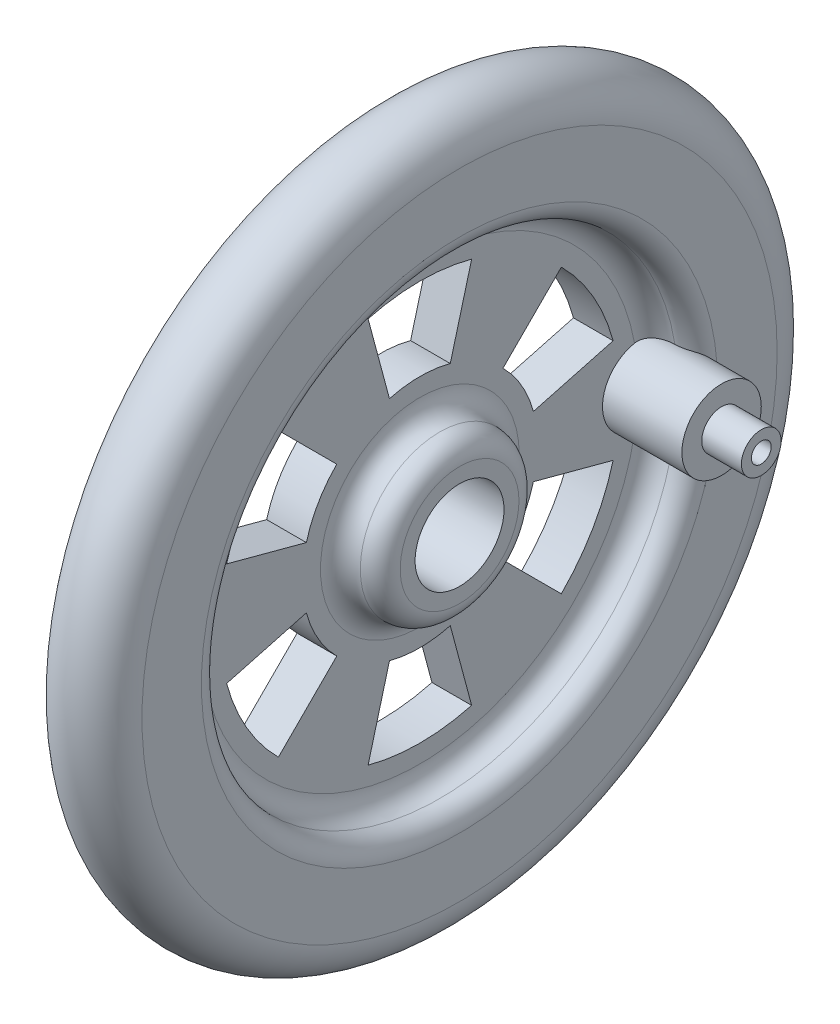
from build123d import *

# Parameters (mm, degrees)
SKETCH2_R           = 19.05
SKETCH2_R_2         = 6.35
CUT_EXTRUDE1_DEPTH  = 3.175
FILLET1_R           = 1.6002
FILLET2_R           = 1.6002
FILLET3_R           = 1.6002
SKETCH3_R           = 3.556
CUT_EXTRUDE2_DEPTH  = 41.907013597
CUT_EXTRUDE3_DEPTH  = 41.535686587
CIRPATTERN1_COUNT   = 6
SKETCH5_R           = 3.175
BOSS_EXTRUDE1_DEPTH = 6.35
SKETCH6_R           = 1.5875
BOSS_EXTRUDE2_DEPTH = 3.175
SKETCH7_R           = 0.79375
CUT_EXTRUDE4_DEPTH  = 6.35


with BuildPart() as part:
    # Sketch1 → Revolve1 (revolve)
    with BuildSketch(Plane.XY, mode=Mode.PRIVATE) as revolve1_sk:
        with BuildLine():
            Line((0, 0), (6.35, 0))
            Line((6.35, 0), (6.35, 25.4))
            ThreePointArc((6.35, 25.4), (3.175, 28.575), (0, 25.4))
            Line((0, 25.4), (0, 0))
        make_face()
    revolve(revolve1_sk.sketch.rotate(Axis((0, 0, 0), (-1, 0, 0)), 90), axis=Axis((0, 0, 0), (-1, 0, 0)))

    # Sketch2 → Cut-Extrude1 (cut)
    with BuildSketch(Plane(origin=(6.35, 0, 0), x_dir=(0, 0, -1), z_dir=(1, 0, 0))):
        Circle(SKETCH2_R)
        Circle(SKETCH2_R_2, mode=Mode.SUBTRACT)
    extrude(amount=-CUT_EXTRUDE1_DEPTH, mode=Mode.SUBTRACT)

    # Fillet1
    fillet1_edges = [part.edges().sort_by_distance(p)[0] for p in [
        (6.35, 0, 6.35),
    ]]
    fillet(fillet1_edges, radius=FILLET1_R)

    # Fillet2
    fillet2_edges = [part.edges().sort_by_distance(p)[0] for p in [
        (3.175, 0, 6.35),
        (3.175, 0, 19.05),
    ]]
    fillet(fillet2_edges, radius=FILLET2_R)

    # Fillet3
    fillet3_edges = [part.edges().sort_by_distance(p)[0] for p in [
        (6.35, 0, 19.05),
    ]]
    fillet(fillet3_edges, radius=FILLET3_R)

    # Sketch3 → Cut-Extrude2 (cut, through all)
    with BuildSketch(Plane(origin=(6.35, 0, 0), x_dir=(0, 0, -1), z_dir=(1, 0, 0))):
        Circle(SKETCH3_R)
    extrude(amount=-CUT_EXTRUDE2_DEPTH, mode=Mode.SUBTRACT)

    # Sketch4 → Cut-Extrude3 (cut, through all)
    with BuildSketch(Plane(origin=(3.175, 0, 0), x_dir=(0, 0, -1), z_dir=(1, 0, 0))):
        with BuildLine():
            Line((6.64538953, 6.64538953), (11.315122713, 11.315122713))
            ThreePointArc((11.315122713, 11.315122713), (13.858138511, 8.001), (15.456745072, 4.14162236))
            Line((15.456745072, 4.14162236), (9.077770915, 2.432381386))
            ThreePointArc((9.077770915, 2.432381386), (8.138906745, 4.699), (6.64538953, 6.64538953))
        make_face()
    cut_extrude3 = extrude(amount=-CUT_EXTRUDE3_DEPTH, mode=Mode.SUBTRACT)

    # CirPattern1: Cut-Extrude3 ×6 about axis
    cirpattern1_axis = Axis((0, 0, 0), (1, 0, 0))
    for i in range(1, CIRPATTERN1_COUNT):
        add(cut_extrude3.rotate(cirpattern1_axis, i * 360 / CIRPATTERN1_COUNT), mode=Mode.SUBTRACT)

    # Sketch5 → Boss-Extrude1 (add)
    with BuildSketch(Plane(origin=(3.175, 0, 0), x_dir=(0, 0, -1), z_dir=(1, 0, 0))):
        with Locations(Location((17.78, 0, 0), (0, 0, 101.088207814))):
            Circle(SKETCH5_R)
    extrude(amount=BOSS_EXTRUDE1_DEPTH)

    # Sketch6 → Boss-Extrude2 (add)
    with BuildSketch(Plane(origin=(9.525, 0, 0), x_dir=(0, 0, -1), z_dir=(1, 0, 0))):
        with Locations((17.78, 0)):
            Circle(SKETCH6_R)
    extrude(amount=BOSS_EXTRUDE2_DEPTH)

    # Sketch7 → Cut-Extrude4 (cut)
    with BuildSketch(Plane(origin=(12.7, 0, 0), x_dir=(0, 0, -1), z_dir=(1, 0, 0))):
        with Locations((17.78, 0)):
            Circle(SKETCH7_R)
    extrude(amount=-CUT_EXTRUDE4_DEPTH, mode=Mode.SUBTRACT)


solid = part.part
